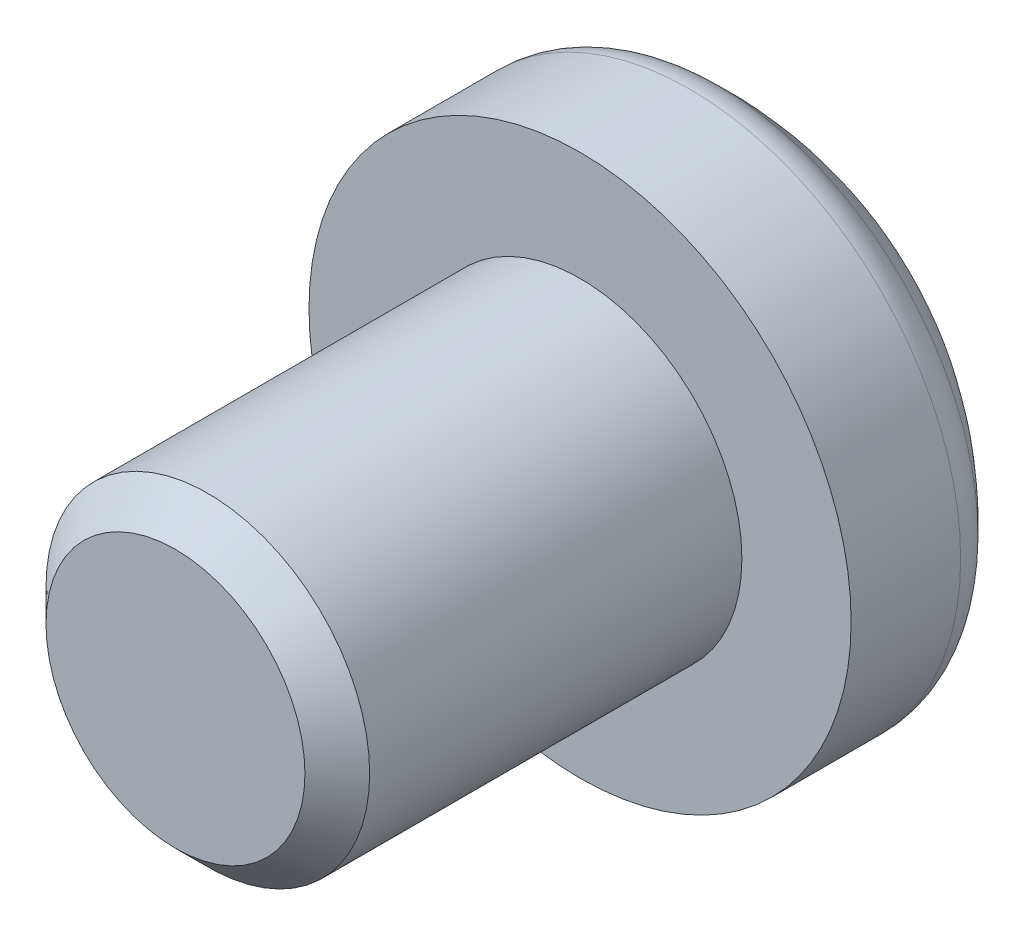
ISO-10303-21;
HEADER;
FILE_DESCRIPTION(('STEP AP214'),'2;1');
FILE_NAME('part.step','',(''),(''),'','','');
FILE_SCHEMA(('AUTOMOTIVE_DESIGN { 1 0 10303 214 1 1 1 1 }'));
ENDSEC;
DATA;
#1=APPLICATION_CONTEXT('core data for automotive mechanical design processes');
#2=APPLICATION_PROTOCOL_DEFINITION('international standard','automotive_design',2000,#1);
#3=PRODUCT_CONTEXT('',#1,'mechanical');
#4=PRODUCT('Part','Part','',(#3));
#5=PRODUCT_RELATED_PRODUCT_CATEGORY('part','',(#4));
#6=PRODUCT_DEFINITION_FORMATION('','',#4);
#7=PRODUCT_DEFINITION_CONTEXT('part definition',#1,'design');
#8=PRODUCT_DEFINITION('design','',#6,#7);
#9=PRODUCT_DEFINITION_SHAPE('','',#8);
#10=(LENGTH_UNIT() NAMED_UNIT(*) SI_UNIT(.MILLI.,.METRE.));
#11=(NAMED_UNIT(*) PLANE_ANGLE_UNIT() SI_UNIT($,.RADIAN.));
#12=(NAMED_UNIT(*) SI_UNIT($,.STERADIAN.) SOLID_ANGLE_UNIT());
#13=UNCERTAINTY_MEASURE_WITH_UNIT(LENGTH_MEASURE(1.E-05),#10,'distance_accuracy_value','');
#14=(GEOMETRIC_REPRESENTATION_CONTEXT(3) GLOBAL_UNCERTAINTY_ASSIGNED_CONTEXT((#13)) GLOBAL_UNIT_ASSIGNED_CONTEXT((#10,
#11,#12)) REPRESENTATION_CONTEXT('',''));
#15=CARTESIAN_POINT('',(0.,0.,0.));
#16=DIRECTION('',(0.,0.,1.));
#17=DIRECTION('',(1.,0.,0.));
#18=AXIS2_PLACEMENT_3D('',#15,#16,#17);
#19=CARTESIAN_POINT('',(0.,0.,1.29516129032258));
#20=DIRECTION('',(0.,0.,-1.));
#21=DIRECTION('',(1.,0.,0.));
#22=AXIS2_PLACEMENT_3D('',#19,#20,#21);
#23=SPHERICAL_SURFACE('',#22,4.39516129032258);
#24=CARTESIAN_POINT('',(0.,0.,-1.70623740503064));
#25=DIRECTION('',(0.,0.,-1.));
#26=DIRECTION('',(-1.,0.,0.));
#27=AXIS2_PLACEMENT_3D('',#24,#25,#26);
#28=CIRCLE('',#27,3.21077072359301);
#29=CARTESIAN_POINT('',(-3.21077072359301,0.,-1.70623740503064));
#30=VERTEX_POINT('',#29);
#31=EDGE_CURVE('E148',#30,#30,#28,.T.);
#32=ORIENTED_EDGE('',*,*,#31,.T.);
#33=EDGE_LOOP('',(#32));
#34=FACE_BOUND('',#33,.T.);
#35=CARTESIAN_POINT('',(-2.35,0.,1.29516129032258));
#36=DIRECTION('',(1.,0.,0.));
#37=DIRECTION('',(0.,0.,-1.));
#38=AXIS2_PLACEMENT_3D('',#35,#36,#37);
#39=CIRCLE('',#38,3.71415438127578);
#40=CARTESIAN_POINT('',(-2.35,-0.6,-2.37020946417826));
#41=VERTEX_POINT('',#40);
#42=CARTESIAN_POINT('',(-2.35,0.6,-2.37020946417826));
#43=VERTEX_POINT('',#42);
#44=EDGE_CURVE('E172',#41,#43,#39,.T.);
#45=ORIENTED_EDGE('',*,*,#44,.F.);
#46=CARTESIAN_POINT('',(0.,-0.6,1.29516129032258));
#47=DIRECTION('',(0.,1.,0.));
#48=DIRECTION('',(-1.,0.,0.));
#49=AXIS2_PLACEMENT_3D('',#46,#47,#48);
#50=CIRCLE('',#49,4.35401455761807);
#51=CARTESIAN_POINT('',(-0.6,-0.6,-3.01731395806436));
#52=VERTEX_POINT('',#51);
#53=EDGE_CURVE('E52',#52,#41,#50,.T.);
#54=ORIENTED_EDGE('',*,*,#53,.F.);
#55=CARTESIAN_POINT('',(-0.6,0.,1.29516129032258));
#56=DIRECTION('',(1.,0.,0.));
#57=DIRECTION('',(0.,1.,0.));
#58=AXIS2_PLACEMENT_3D('',#55,#56,#57);
#59=CIRCLE('',#58,4.35401455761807);
#60=CARTESIAN_POINT('',(-0.6,-2.35,-2.37020946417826));
#61=VERTEX_POINT('',#60);
#62=EDGE_CURVE('E169',#61,#52,#59,.T.);
#63=ORIENTED_EDGE('',*,*,#62,.F.);
#64=CARTESIAN_POINT('',(0.,-2.35,1.29516129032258));
#65=DIRECTION('',(0.,1.,0.));
#66=DIRECTION('',(0.,0.,1.));
#67=AXIS2_PLACEMENT_3D('',#64,#65,#66);
#68=CIRCLE('',#67,3.71415438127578);
#69=CARTESIAN_POINT('',(0.6,-2.35,-2.37020946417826));
#70=VERTEX_POINT('',#69);
#71=EDGE_CURVE('E167',#70,#61,#68,.T.);
#72=ORIENTED_EDGE('',*,*,#71,.F.);
#73=CARTESIAN_POINT('',(0.6,0.,1.29516129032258));
#74=DIRECTION('',(-1.,0.,0.));
#75=DIRECTION('',(0.,-1.,0.));
#76=AXIS2_PLACEMENT_3D('',#73,#74,#75);
#77=CIRCLE('',#76,4.35401455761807);
#78=CARTESIAN_POINT('',(0.6,-0.6,-3.01731395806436));
#79=VERTEX_POINT('',#78);
#80=EDGE_CURVE('E165',#79,#70,#77,.T.);
#81=ORIENTED_EDGE('',*,*,#80,.F.);
#82=CARTESIAN_POINT('',(0.,-0.6,1.29516129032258));
#83=DIRECTION('',(0.,1.,0.));
#84=DIRECTION('',(-1.,0.,0.));
#85=AXIS2_PLACEMENT_3D('',#82,#83,#84);
#86=CIRCLE('',#85,4.35401455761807);
#87=CARTESIAN_POINT('',(2.35,-0.6,-2.37020946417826));
#88=VERTEX_POINT('',#87);
#89=EDGE_CURVE('E163',#88,#79,#86,.T.);
#90=ORIENTED_EDGE('',*,*,#89,.F.);
#91=CARTESIAN_POINT('',(2.35,0.,1.29516129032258));
#92=DIRECTION('',(-1.,0.,0.));
#93=DIRECTION('',(0.,-1.,0.));
#94=AXIS2_PLACEMENT_3D('',#91,#92,#93);
#95=CIRCLE('',#94,3.71415438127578);
#96=CARTESIAN_POINT('',(2.35,0.6,-2.37020946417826));
#97=VERTEX_POINT('',#96);
#98=EDGE_CURVE('E161',#97,#88,#95,.T.);
#99=ORIENTED_EDGE('',*,*,#98,.F.);
#100=CARTESIAN_POINT('',(0.,0.6,1.29516129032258));
#101=DIRECTION('',(0.,-1.,0.));
#102=DIRECTION('',(1.,0.,0.));
#103=AXIS2_PLACEMENT_3D('',#100,#101,#102);
#104=CIRCLE('',#103,4.35401455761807);
#105=CARTESIAN_POINT('',(0.6,0.6,-3.01731395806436));
#106=VERTEX_POINT('',#105);
#107=EDGE_CURVE('E159',#106,#97,#104,.T.);
#108=ORIENTED_EDGE('',*,*,#107,.F.);
#109=CARTESIAN_POINT('',(0.6,0.,1.29516129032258));
#110=DIRECTION('',(-1.,0.,0.));
#111=DIRECTION('',(0.,-1.,0.));
#112=AXIS2_PLACEMENT_3D('',#109,#110,#111);
#113=CIRCLE('',#112,4.35401455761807);
#114=CARTESIAN_POINT('',(0.6,2.35,-2.37020946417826));
#115=VERTEX_POINT('',#114);
#116=EDGE_CURVE('E157',#115,#106,#113,.T.);
#117=ORIENTED_EDGE('',*,*,#116,.F.);
#118=CARTESIAN_POINT('',(0.,2.35,1.29516129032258));
#119=DIRECTION('',(0.,-1.,0.));
#120=DIRECTION('',(0.,0.,-1.));
#121=AXIS2_PLACEMENT_3D('',#118,#119,#120);
#122=CIRCLE('',#121,3.71415438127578);
#123=CARTESIAN_POINT('',(-0.6,2.35,-2.37020946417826));
#124=VERTEX_POINT('',#123);
#125=EDGE_CURVE('E155',#124,#115,#122,.T.);
#126=ORIENTED_EDGE('',*,*,#125,.F.);
#127=CARTESIAN_POINT('',(-0.6,0.,1.29516129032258));
#128=DIRECTION('',(1.,0.,0.));
#129=DIRECTION('',(0.,1.,0.));
#130=AXIS2_PLACEMENT_3D('',#127,#128,#129);
#131=CIRCLE('',#130,4.35401455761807);
#132=CARTESIAN_POINT('',(-0.6,0.6,-3.01731395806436));
#133=VERTEX_POINT('',#132);
#134=EDGE_CURVE('E153',#133,#124,#131,.T.);
#135=ORIENTED_EDGE('',*,*,#134,.F.);
#136=CARTESIAN_POINT('',(0.,0.6,1.29516129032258));
#137=DIRECTION('',(0.,-1.,0.));
#138=DIRECTION('',(1.,0.,0.));
#139=AXIS2_PLACEMENT_3D('',#136,#137,#138);
#140=CIRCLE('',#139,4.35401455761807);
#141=EDGE_CURVE('E151',#43,#133,#140,.T.);
#142=ORIENTED_EDGE('',*,*,#141,.F.);
#143=EDGE_LOOP('',(#45,#54,#63,#72,#81,#90,#99,#108,#117,#126,#135,#142));
#144=FACE_BOUND('',#143,.T.);
#145=ADVANCED_FACE('F30',(#34,#144),#23,.T.);
#146=CARTESIAN_POINT('',(0.,0.,-1.3534124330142));
#147=DIRECTION('',(0.,0.,-1.));
#148=DIRECTION('',(-1.,0.,0.));
#149=AXIS2_PLACEMENT_3D('',#146,#147,#148);
#150=TOROIDAL_SURFACE('',#149,2.83333333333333,0.516666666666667);
#151=ORIENTED_EDGE('',*,*,#31,.F.);
#152=EDGE_LOOP('',(#151));
#153=FACE_BOUND('',#152,.T.);
#154=CARTESIAN_POINT('',(0.,0.,-1.3534124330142));
#155=DIRECTION('',(0.,0.,-1.));
#156=DIRECTION('',(-1.,0.,0.));
#157=AXIS2_PLACEMENT_3D('',#154,#155,#156);
#158=CIRCLE('',#157,3.35);
#159=CARTESIAN_POINT('',(-3.35,0.,-1.3534124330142));
#160=VERTEX_POINT('',#159);
#161=EDGE_CURVE('E140',#160,#160,#158,.T.);
#162=ORIENTED_EDGE('',*,*,#161,.T.);
#163=EDGE_LOOP('',(#162));
#164=FACE_BOUND('',#163,.T.);
#165=ADVANCED_FACE('F190',(#153,#164),#150,.T.);
#166=CARTESIAN_POINT('',(0.,0.,0.));
#167=DIRECTION('',(0.,0.,-1.));
#168=DIRECTION('',(-1.,0.,0.));
#169=AXIS2_PLACEMENT_3D('',#166,#167,#168);
#170=CYLINDRICAL_SURFACE('',#169,3.35);
#171=ORIENTED_EDGE('',*,*,#161,.F.);
#172=EDGE_LOOP('',(#171));
#173=FACE_BOUND('',#172,.T.);
#174=CARTESIAN_POINT('',(0.,0.,0.));
#175=DIRECTION('',(0.,0.,-1.));
#176=DIRECTION('',(-1.,0.,0.));
#177=AXIS2_PLACEMENT_3D('',#174,#175,#176);
#178=CIRCLE('',#177,3.35);
#179=CARTESIAN_POINT('',(-3.35,0.,0.));
#180=VERTEX_POINT('',#179);
#181=EDGE_CURVE('E136',#180,#180,#178,.T.);
#182=ORIENTED_EDGE('',*,*,#181,.T.);
#183=EDGE_LOOP('',(#182));
#184=FACE_BOUND('',#183,.T.);
#185=ADVANCED_FACE('F195',(#173,#184),#170,.T.);
#186=CARTESIAN_POINT('',(0.,0.,0.));
#187=DIRECTION('',(0.,0.,-1.));
#188=DIRECTION('',(-1.,0.,0.));
#189=AXIS2_PLACEMENT_3D('',#186,#187,#188);
#190=PLANE('',#189);
#191=CARTESIAN_POINT('',(0.,0.,0.));
#192=DIRECTION('',(0.,0.,1.));
#193=DIRECTION('',(1.,0.,0.));
#194=AXIS2_PLACEMENT_3D('',#191,#192,#193);
#195=CIRCLE('',#194,2.);
#196=CARTESIAN_POINT('',(2.,0.,0.));
#197=VERTEX_POINT('',#196);
#198=EDGE_CURVE('E133',#197,#197,#195,.T.);
#199=ORIENTED_EDGE('',*,*,#198,.F.);
#200=EDGE_LOOP('',(#199));
#201=FACE_BOUND('',#200,.T.);
#202=ORIENTED_EDGE('',*,*,#181,.F.);
#203=EDGE_LOOP('',(#202));
#204=FACE_BOUND('',#203,.T.);
#205=ADVANCED_FACE('F307',(#201,#204),#190,.F.);
#206=CARTESIAN_POINT('',(-2.35,0.6,-2.1));
#207=DIRECTION('',(1.,0.,0.));
#208=DIRECTION('',(0.,0.,-1.));
#209=AXIS2_PLACEMENT_3D('',#206,#207,#208);
#210=PLANE('',#209);
#211=ORIENTED_EDGE('',*,*,#44,.T.);
#212=DIRECTION('',(0.,0.,-1.));
#213=VECTOR('',#212,1.);
#214=CARTESIAN_POINT('',(-2.35,0.6,-2.1));
#215=LINE('',#214,#213);
#216=CARTESIAN_POINT('',(-2.35,0.6,-2.1));
#217=VERTEX_POINT('',#216);
#218=EDGE_CURVE('E44',#217,#43,#215,.T.);
#219=ORIENTED_EDGE('',*,*,#218,.F.);
#220=DIRECTION('',(0.,-1.,0.));
#221=VECTOR('',#220,1.);
#222=CARTESIAN_POINT('',(-2.35,0.6,-2.1));
#223=LINE('',#222,#221);
#224=CARTESIAN_POINT('',(-2.35,-0.6,-2.1));
#225=VERTEX_POINT('',#224);
#226=EDGE_CURVE('E124',#217,#225,#223,.T.);
#227=ORIENTED_EDGE('',*,*,#226,.T.);
#228=DIRECTION('',(0.,0.,-1.));
#229=VECTOR('',#228,1.);
#230=CARTESIAN_POINT('',(-2.35,-0.6,-2.1));
#231=LINE('',#230,#229);
#232=EDGE_CURVE('E131',#225,#41,#231,.T.);
#233=ORIENTED_EDGE('',*,*,#232,.T.);
#234=EDGE_LOOP('',(#211,#219,#227,#233));
#235=FACE_BOUND('',#234,.T.);
#236=ADVANCED_FACE('F130',(#235),#210,.T.);
#237=CARTESIAN_POINT('',(-2.35,-0.6,-2.1));
#238=DIRECTION('',(0.,1.,0.));
#239=DIRECTION('',(-1.,0.,0.));
#240=AXIS2_PLACEMENT_3D('',#237,#238,#239);
#241=PLANE('',#240);
#242=ORIENTED_EDGE('',*,*,#53,.T.);
#243=ORIENTED_EDGE('',*,*,#232,.F.);
#244=DIRECTION('',(1.,0.,0.));
#245=VECTOR('',#244,1.);
#246=CARTESIAN_POINT('',(-2.35,-0.6,-2.1));
#247=LINE('',#246,#245);
#248=CARTESIAN_POINT('',(-0.6,-0.6,-2.1));
#249=VERTEX_POINT('',#248);
#250=EDGE_CURVE('E120',#225,#249,#247,.T.);
#251=ORIENTED_EDGE('',*,*,#250,.T.);
#252=DIRECTION('',(0.,0.,-1.));
#253=VECTOR('',#252,1.);
#254=CARTESIAN_POINT('',(-0.6,-0.6,-2.1));
#255=LINE('',#254,#253);
#256=EDGE_CURVE('E137',#249,#52,#255,.T.);
#257=ORIENTED_EDGE('',*,*,#256,.T.);
#258=EDGE_LOOP('',(#242,#243,#251,#257));
#259=FACE_BOUND('',#258,.T.);
#260=ADVANCED_FACE('F135',(#259),#241,.T.);
#261=CARTESIAN_POINT('',(-0.6,-0.6,-2.1));
#262=DIRECTION('',(1.,0.,0.));
#263=DIRECTION('',(0.,1.,0.));
#264=AXIS2_PLACEMENT_3D('',#261,#262,#263);
#265=PLANE('',#264);
#266=ORIENTED_EDGE('',*,*,#62,.T.);
#267=ORIENTED_EDGE('',*,*,#256,.F.);
#268=DIRECTION('',(0.,-1.,0.));
#269=VECTOR('',#268,1.);
#270=CARTESIAN_POINT('',(-0.6,-0.6,-2.1));
#271=LINE('',#270,#269);
#272=CARTESIAN_POINT('',(-0.6,-2.35,-2.1));
#273=VERTEX_POINT('',#272);
#274=EDGE_CURVE('E126',#249,#273,#271,.T.);
#275=ORIENTED_EDGE('',*,*,#274,.T.);
#276=DIRECTION('',(0.,0.,-1.));
#277=VECTOR('',#276,1.);
#278=CARTESIAN_POINT('',(-0.6,-2.35,-2.1));
#279=LINE('',#278,#277);
#280=EDGE_CURVE('E142',#273,#61,#279,.T.);
#281=ORIENTED_EDGE('',*,*,#280,.T.);
#282=EDGE_LOOP('',(#266,#267,#275,#281));
#283=FACE_BOUND('',#282,.T.);
#284=ADVANCED_FACE('F240',(#283),#265,.T.);
#285=CARTESIAN_POINT('',(-0.6,-2.35,-2.1));
#286=DIRECTION('',(0.,1.,0.));
#287=DIRECTION('',(0.,0.,1.));
#288=AXIS2_PLACEMENT_3D('',#285,#286,#287);
#289=PLANE('',#288);
#290=ORIENTED_EDGE('',*,*,#71,.T.);
#291=ORIENTED_EDGE('',*,*,#280,.F.);
#292=DIRECTION('',(1.,0.,0.));
#293=VECTOR('',#292,1.);
#294=CARTESIAN_POINT('',(-0.6,-2.35,-2.1));
#295=LINE('',#294,#293);
#296=CARTESIAN_POINT('',(0.6,-2.35,-2.1));
#297=VERTEX_POINT('',#296);
#298=EDGE_CURVE('E247',#273,#297,#295,.T.);
#299=ORIENTED_EDGE('',*,*,#298,.T.);
#300=DIRECTION('',(0.,0.,-1.));
#301=VECTOR('',#300,1.);
#302=CARTESIAN_POINT('',(0.6,-2.35,-2.1));
#303=LINE('',#302,#301);
#304=EDGE_CURVE('E235',#297,#70,#303,.T.);
#305=ORIENTED_EDGE('',*,*,#304,.T.);
#306=EDGE_LOOP('',(#290,#291,#299,#305));
#307=FACE_BOUND('',#306,.T.);
#308=ADVANCED_FACE('F245',(#307),#289,.T.);
#309=CARTESIAN_POINT('',(0.6,-0.6,-2.1));
#310=DIRECTION('',(-1.,0.,0.));
#311=DIRECTION('',(0.,-1.,0.));
#312=AXIS2_PLACEMENT_3D('',#309,#310,#311);
#313=PLANE('',#312);
#314=ORIENTED_EDGE('',*,*,#80,.T.);
#315=ORIENTED_EDGE('',*,*,#304,.F.);
#316=DIRECTION('',(0.,1.,0.));
#317=VECTOR('',#316,1.);
#318=CARTESIAN_POINT('',(0.6,-0.6,-2.1));
#319=LINE('',#318,#317);
#320=CARTESIAN_POINT('',(0.6,-0.6,-2.1));
#321=VERTEX_POINT('',#320);
#322=EDGE_CURVE('E251',#297,#321,#319,.T.);
#323=ORIENTED_EDGE('',*,*,#322,.T.);
#324=DIRECTION('',(0.,0.,-1.));
#325=VECTOR('',#324,1.);
#326=CARTESIAN_POINT('',(0.6,-0.6,-2.1));
#327=LINE('',#326,#325);
#328=EDGE_CURVE('E232',#321,#79,#327,.T.);
#329=ORIENTED_EDGE('',*,*,#328,.T.);
#330=EDGE_LOOP('',(#314,#315,#323,#329));
#331=FACE_BOUND('',#330,.T.);
#332=ADVANCED_FACE('F250',(#331),#313,.T.);
#333=CARTESIAN_POINT('',(0.6,-0.6,-2.1));
#334=DIRECTION('',(0.,1.,0.));
#335=DIRECTION('',(-1.,0.,0.));
#336=AXIS2_PLACEMENT_3D('',#333,#334,#335);
#337=PLANE('',#336);
#338=ORIENTED_EDGE('',*,*,#89,.T.);
#339=ORIENTED_EDGE('',*,*,#328,.F.);
#340=DIRECTION('',(1.,0.,0.));
#341=VECTOR('',#340,1.);
#342=CARTESIAN_POINT('',(0.6,-0.6,-2.1));
#343=LINE('',#342,#341);
#344=CARTESIAN_POINT('',(2.35,-0.6,-2.1));
#345=VERTEX_POINT('',#344);
#346=EDGE_CURVE('E255',#321,#345,#343,.T.);
#347=ORIENTED_EDGE('',*,*,#346,.T.);
#348=DIRECTION('',(0.,0.,-1.));
#349=VECTOR('',#348,1.);
#350=CARTESIAN_POINT('',(2.35,-0.6,-2.1));
#351=LINE('',#350,#349);
#352=EDGE_CURVE('E229',#345,#88,#351,.T.);
#353=ORIENTED_EDGE('',*,*,#352,.T.);
#354=EDGE_LOOP('',(#338,#339,#347,#353));
#355=FACE_BOUND('',#354,.T.);
#356=ADVANCED_FACE('F288',(#355),#337,.T.);
#357=CARTESIAN_POINT('',(2.35,0.6,-2.1));
#358=DIRECTION('',(-1.,0.,0.));
#359=DIRECTION('',(0.,-1.,0.));
#360=AXIS2_PLACEMENT_3D('',#357,#358,#359);
#361=PLANE('',#360);
#362=ORIENTED_EDGE('',*,*,#98,.T.);
#363=ORIENTED_EDGE('',*,*,#352,.F.);
#364=DIRECTION('',(0.,1.,0.));
#365=VECTOR('',#364,1.);
#366=CARTESIAN_POINT('',(2.35,0.6,-2.1));
#367=LINE('',#366,#365);
#368=CARTESIAN_POINT('',(2.35,0.6,-2.1));
#369=VERTEX_POINT('',#368);
#370=EDGE_CURVE('E257',#345,#369,#367,.T.);
#371=ORIENTED_EDGE('',*,*,#370,.T.);
#372=DIRECTION('',(0.,0.,-1.));
#373=VECTOR('',#372,1.);
#374=CARTESIAN_POINT('',(2.35,0.6,-2.1));
#375=LINE('',#374,#373);
#376=EDGE_CURVE('E226',#369,#97,#375,.T.);
#377=ORIENTED_EDGE('',*,*,#376,.T.);
#378=EDGE_LOOP('',(#362,#363,#371,#377));
#379=FACE_BOUND('',#378,.T.);
#380=ADVANCED_FACE('F285',(#379),#361,.T.);
#381=CARTESIAN_POINT('',(0.6,0.6,-2.1));
#382=DIRECTION('',(0.,-1.,0.));
#383=DIRECTION('',(1.,0.,0.));
#384=AXIS2_PLACEMENT_3D('',#381,#382,#383);
#385=PLANE('',#384);
#386=ORIENTED_EDGE('',*,*,#107,.T.);
#387=ORIENTED_EDGE('',*,*,#376,.F.);
#388=DIRECTION('',(-1.,0.,0.));
#389=VECTOR('',#388,1.);
#390=CARTESIAN_POINT('',(0.6,0.6,-2.1));
#391=LINE('',#390,#389);
#392=CARTESIAN_POINT('',(0.6,0.6,-2.1));
#393=VERTEX_POINT('',#392);
#394=EDGE_CURVE('E263',#369,#393,#391,.T.);
#395=ORIENTED_EDGE('',*,*,#394,.T.);
#396=DIRECTION('',(0.,0.,-1.));
#397=VECTOR('',#396,1.);
#398=CARTESIAN_POINT('',(0.6,0.6,-2.1));
#399=LINE('',#398,#397);
#400=EDGE_CURVE('E223',#393,#106,#399,.T.);
#401=ORIENTED_EDGE('',*,*,#400,.T.);
#402=EDGE_LOOP('',(#386,#387,#395,#401));
#403=FACE_BOUND('',#402,.T.);
#404=ADVANCED_FACE('F283',(#403),#385,.T.);
#405=CARTESIAN_POINT('',(0.6,2.35,-2.1));
#406=DIRECTION('',(-1.,0.,0.));
#407=DIRECTION('',(0.,-1.,0.));
#408=AXIS2_PLACEMENT_3D('',#405,#406,#407);
#409=PLANE('',#408);
#410=ORIENTED_EDGE('',*,*,#116,.T.);
#411=ORIENTED_EDGE('',*,*,#400,.F.);
#412=DIRECTION('',(0.,1.,0.));
#413=VECTOR('',#412,1.);
#414=CARTESIAN_POINT('',(0.6,2.35,-2.1));
#415=LINE('',#414,#413);
#416=CARTESIAN_POINT('',(0.6,2.35,-2.1));
#417=VERTEX_POINT('',#416);
#418=EDGE_CURVE('E265',#393,#417,#415,.T.);
#419=ORIENTED_EDGE('',*,*,#418,.T.);
#420=DIRECTION('',(0.,0.,-1.));
#421=VECTOR('',#420,1.);
#422=CARTESIAN_POINT('',(0.6,2.35,-2.1));
#423=LINE('',#422,#421);
#424=EDGE_CURVE('E215',#417,#115,#423,.T.);
#425=ORIENTED_EDGE('',*,*,#424,.T.);
#426=EDGE_LOOP('',(#410,#411,#419,#425));
#427=FACE_BOUND('',#426,.T.);
#428=ADVANCED_FACE('F277',(#427),#409,.T.);
#429=CARTESIAN_POINT('',(-0.6,2.35,-2.1));
#430=DIRECTION('',(0.,-1.,0.));
#431=DIRECTION('',(0.,0.,-1.));
#432=AXIS2_PLACEMENT_3D('',#429,#430,#431);
#433=PLANE('',#432);
#434=ORIENTED_EDGE('',*,*,#125,.T.);
#435=ORIENTED_EDGE('',*,*,#424,.F.);
#436=DIRECTION('',(-1.,0.,0.));
#437=VECTOR('',#436,1.);
#438=CARTESIAN_POINT('',(-0.6,2.35,-2.1));
#439=LINE('',#438,#437);
#440=CARTESIAN_POINT('',(-0.6,2.35,-2.1));
#441=VERTEX_POINT('',#440);
#442=EDGE_CURVE('E267',#417,#441,#439,.T.);
#443=ORIENTED_EDGE('',*,*,#442,.T.);
#444=DIRECTION('',(0.,0.,-1.));
#445=VECTOR('',#444,1.);
#446=CARTESIAN_POINT('',(-0.6,2.35,-2.1));
#447=LINE('',#446,#445);
#448=EDGE_CURVE('E213',#441,#124,#447,.T.);
#449=ORIENTED_EDGE('',*,*,#448,.T.);
#450=EDGE_LOOP('',(#434,#435,#443,#449));
#451=FACE_BOUND('',#450,.T.);
#452=ADVANCED_FACE('F274',(#451),#433,.T.);
#453=CARTESIAN_POINT('',(-0.6,2.35,-2.1));
#454=DIRECTION('',(1.,0.,0.));
#455=DIRECTION('',(0.,1.,0.));
#456=AXIS2_PLACEMENT_3D('',#453,#454,#455);
#457=PLANE('',#456);
#458=ORIENTED_EDGE('',*,*,#134,.T.);
#459=ORIENTED_EDGE('',*,*,#448,.F.);
#460=DIRECTION('',(0.,-1.,0.));
#461=VECTOR('',#460,1.);
#462=CARTESIAN_POINT('',(-0.6,2.35,-2.1));
#463=LINE('',#462,#461);
#464=CARTESIAN_POINT('',(-0.6,0.6,-2.1));
#465=VERTEX_POINT('',#464);
#466=EDGE_CURVE('E212',#441,#465,#463,.T.);
#467=ORIENTED_EDGE('',*,*,#466,.T.);
#468=DIRECTION('',(0.,0.,-1.));
#469=VECTOR('',#468,1.);
#470=CARTESIAN_POINT('',(-0.6,0.6,-2.1));
#471=LINE('',#470,#469);
#472=EDGE_CURVE('E206',#465,#133,#471,.T.);
#473=ORIENTED_EDGE('',*,*,#472,.T.);
#474=EDGE_LOOP('',(#458,#459,#467,#473));
#475=FACE_BOUND('',#474,.T.);
#476=ADVANCED_FACE('F208',(#475),#457,.T.);
#477=CARTESIAN_POINT('',(-2.35,0.6,-2.1));
#478=DIRECTION('',(0.,-1.,0.));
#479=DIRECTION('',(1.,0.,0.));
#480=AXIS2_PLACEMENT_3D('',#477,#478,#479);
#481=PLANE('',#480);
#482=ORIENTED_EDGE('',*,*,#141,.T.);
#483=ORIENTED_EDGE('',*,*,#472,.F.);
#484=DIRECTION('',(-1.,0.,0.));
#485=VECTOR('',#484,1.);
#486=CARTESIAN_POINT('',(-2.35,0.6,-2.1));
#487=LINE('',#486,#485);
#488=EDGE_CURVE('E217',#465,#217,#487,.T.);
#489=ORIENTED_EDGE('',*,*,#488,.T.);
#490=ORIENTED_EDGE('',*,*,#218,.T.);
#491=EDGE_LOOP('',(#482,#483,#489,#490));
#492=FACE_BOUND('',#491,.T.);
#493=ADVANCED_FACE('F205',(#492),#481,.T.);
#494=CARTESIAN_POINT('',(-2.35,-2.35,-2.1));
#495=DIRECTION('',(0.,0.,1.));
#496=DIRECTION('',(1.,0.,0.));
#497=AXIS2_PLACEMENT_3D('',#494,#495,#496);
#498=PLANE('',#497);
#499=ORIENTED_EDGE('',*,*,#226,.F.);
#500=ORIENTED_EDGE('',*,*,#488,.F.);
#501=ORIENTED_EDGE('',*,*,#466,.F.);
#502=ORIENTED_EDGE('',*,*,#442,.F.);
#503=ORIENTED_EDGE('',*,*,#418,.F.);
#504=ORIENTED_EDGE('',*,*,#394,.F.);
#505=ORIENTED_EDGE('',*,*,#370,.F.);
#506=ORIENTED_EDGE('',*,*,#346,.F.);
#507=ORIENTED_EDGE('',*,*,#322,.F.);
#508=ORIENTED_EDGE('',*,*,#298,.F.);
#509=ORIENTED_EDGE('',*,*,#274,.F.);
#510=ORIENTED_EDGE('',*,*,#250,.F.);
#511=EDGE_LOOP('',(#499,#500,#501,#502,#503,#504,#505,#506,#507,#508,#509,#510));
#512=FACE_BOUND('',#511,.T.);
#513=ADVANCED_FACE('F122',(#512),#498,.F.);
#514=CARTESIAN_POINT('',(0.,0.,5.));
#515=DIRECTION('',(0.,0.,1.));
#516=DIRECTION('',(1.,0.,0.));
#517=AXIS2_PLACEMENT_3D('',#514,#515,#516);
#518=PLANE('',#517);
#519=CARTESIAN_POINT('',(0.,0.,5.));
#520=DIRECTION('',(0.,0.,1.));
#521=DIRECTION('',(1.,0.,0.));
#522=AXIS2_PLACEMENT_3D('',#519,#520,#521);
#523=CIRCLE('',#522,1.6);
#524=CARTESIAN_POINT('',(1.6,0.,5.));
#525=VERTEX_POINT('',#524);
#526=EDGE_CURVE('E37',#525,#525,#523,.T.);
#527=ORIENTED_EDGE('',*,*,#526,.T.);
#528=EDGE_LOOP('',(#527));
#529=FACE_BOUND('',#528,.T.);
#530=ADVANCED_FACE('F176',(#529),#518,.T.);
#531=CARTESIAN_POINT('',(0.,0.,0.));
#532=DIRECTION('',(0.,0.,1.));
#533=DIRECTION('',(1.,0.,0.));
#534=AXIS2_PLACEMENT_3D('',#531,#532,#533);
#535=CYLINDRICAL_SURFACE('',#534,2.);
#536=CARTESIAN_POINT('',(0.,0.,4.6));
#537=DIRECTION('',(0.,0.,1.));
#538=DIRECTION('',(1.,0.,0.));
#539=AXIS2_PLACEMENT_3D('',#536,#537,#538);
#540=CIRCLE('',#539,2.);
#541=CARTESIAN_POINT('',(2.,0.,4.6));
#542=VERTEX_POINT('',#541);
#543=EDGE_CURVE('E11',#542,#542,#540,.F.);
#544=ORIENTED_EDGE('',*,*,#543,.T.);
#545=EDGE_LOOP('',(#544));
#546=FACE_BOUND('',#545,.T.);
#547=ORIENTED_EDGE('',*,*,#198,.T.);
#548=EDGE_LOOP('',(#547));
#549=FACE_BOUND('',#548,.T.);
#550=ADVANCED_FACE('F180',(#546,#549),#535,.T.);
#551=CARTESIAN_POINT('',(0.,0.,5.));
#552=DIRECTION('',(0.,0.,-1.));
#553=DIRECTION('',(-1.,0.,0.));
#554=AXIS2_PLACEMENT_3D('',#551,#552,#553);
#555=CONICAL_SURFACE('',#554,1.6,0.785398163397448);
#556=ORIENTED_EDGE('',*,*,#543,.F.);
#557=EDGE_LOOP('',(#556));
#558=FACE_BOUND('',#557,.T.);
#559=ORIENTED_EDGE('',*,*,#526,.F.);
#560=EDGE_LOOP('',(#559));
#561=FACE_BOUND('',#560,.T.);
#562=ADVANCED_FACE('F178',(#558,#561),#555,.T.);
#563=CLOSED_SHELL('',(#145,#165,#185,#205,#236,#260,#284,#308,#332,#356,#380,#404,#428,#452,
#476,#493,#513,#530,#550,#562));
#564=MANIFOLD_SOLID_BREP('B2',#563);
#565=ADVANCED_BREP_SHAPE_REPRESENTATION('',(#18,#564),#14);
#566=SHAPE_DEFINITION_REPRESENTATION(#9,#565);
ENDSEC;
END-ISO-10303-21;
